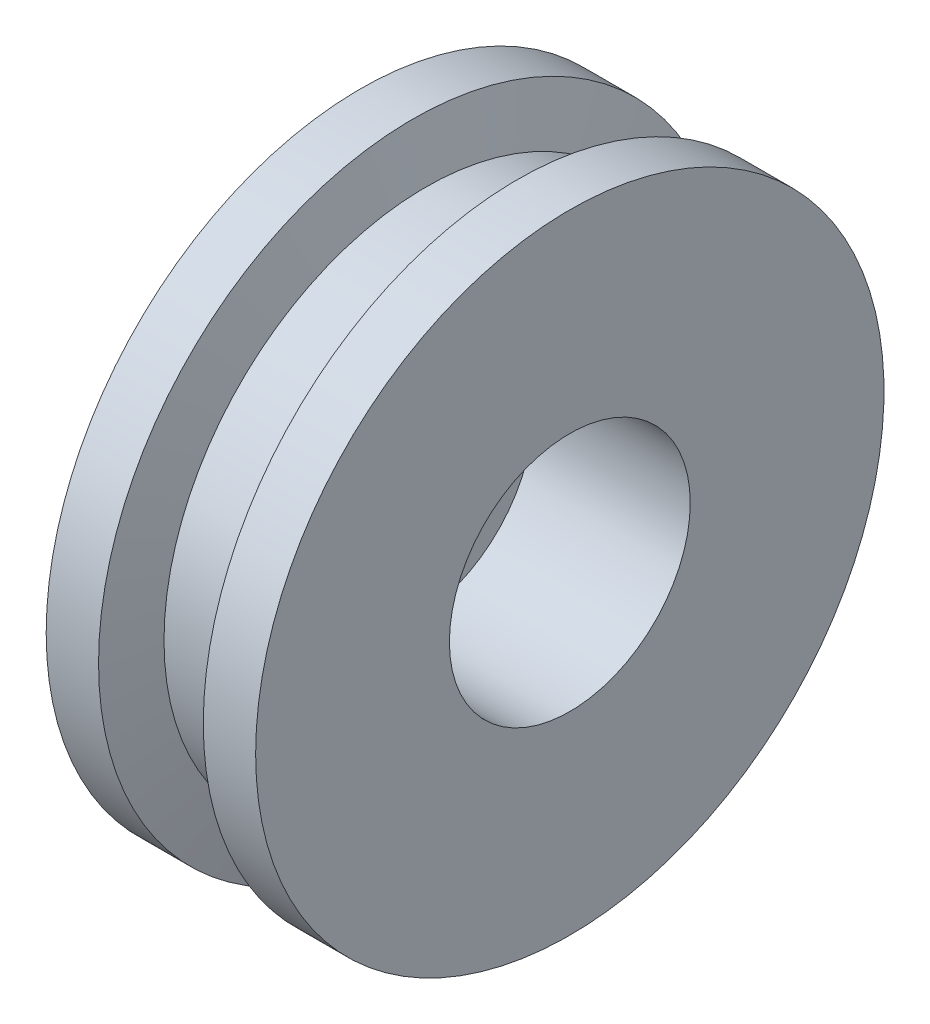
ISO-10303-21;
HEADER;
FILE_DESCRIPTION(('STEP AP214'),'2;1');
FILE_NAME('part.step','',(''),(''),'','','');
FILE_SCHEMA(('AUTOMOTIVE_DESIGN { 1 0 10303 214 1 1 1 1 }'));
ENDSEC;
DATA;
#1=APPLICATION_CONTEXT('core data for automotive mechanical design processes');
#2=APPLICATION_PROTOCOL_DEFINITION('international standard','automotive_design',2000,#1);
#3=PRODUCT_CONTEXT('',#1,'mechanical');
#4=PRODUCT('Part','Part','',(#3));
#5=PRODUCT_RELATED_PRODUCT_CATEGORY('part','',(#4));
#6=PRODUCT_DEFINITION_FORMATION('','',#4);
#7=PRODUCT_DEFINITION_CONTEXT('part definition',#1,'design');
#8=PRODUCT_DEFINITION('design','',#6,#7);
#9=PRODUCT_DEFINITION_SHAPE('','',#8);
#10=(LENGTH_UNIT() NAMED_UNIT(*) SI_UNIT(.MILLI.,.METRE.));
#11=(NAMED_UNIT(*) PLANE_ANGLE_UNIT() SI_UNIT($,.RADIAN.));
#12=(NAMED_UNIT(*) SI_UNIT($,.STERADIAN.) SOLID_ANGLE_UNIT());
#13=UNCERTAINTY_MEASURE_WITH_UNIT(LENGTH_MEASURE(1.E-05),#10,'distance_accuracy_value','');
#14=(GEOMETRIC_REPRESENTATION_CONTEXT(3) GLOBAL_UNCERTAINTY_ASSIGNED_CONTEXT((#13)) GLOBAL_UNIT_ASSIGNED_CONTEXT((#10,
#11,#12)) REPRESENTATION_CONTEXT('',''));
#15=CARTESIAN_POINT('',(0.,0.,0.));
#16=DIRECTION('',(0.,0.,1.));
#17=DIRECTION('',(1.,0.,0.));
#18=AXIS2_PLACEMENT_3D('',#15,#16,#17);
#19=CARTESIAN_POINT('',(-4.,0.,0.));
#20=DIRECTION('',(1.,0.,0.));
#21=DIRECTION('',(0.,0.,-1.));
#22=AXIS2_PLACEMENT_3D('',#19,#20,#21);
#23=PLANE('',#22);
#24=CARTESIAN_POINT('',(-4.,0.,-0.000860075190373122));
#25=DIRECTION('',(-1.,0.,0.));
#26=DIRECTION('',(0.,0.,1.));
#27=AXIS2_PLACEMENT_3D('',#24,#25,#26);
#28=CIRCLE('',#27,3.);
#29=CARTESIAN_POINT('',(-4.,0.,2.99913992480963));
#30=VERTEX_POINT('',#29);
#31=EDGE_CURVE('E76',#30,#30,#28,.T.);
#32=ORIENTED_EDGE('',*,*,#31,.F.);
#33=EDGE_LOOP('',(#32));
#34=FACE_BOUND('',#33,.T.);
#35=CARTESIAN_POINT('',(-4.,0.,0.));
#36=DIRECTION('',(-1.,0.,0.));
#37=DIRECTION('',(0.,0.,1.));
#38=AXIS2_PLACEMENT_3D('',#35,#36,#37);
#39=CIRCLE('',#38,12.);
#40=CARTESIAN_POINT('',(-4.,0.,12.));
#41=VERTEX_POINT('',#40);
#42=EDGE_CURVE('E10',#41,#41,#39,.T.);
#43=ORIENTED_EDGE('',*,*,#42,.T.);
#44=EDGE_LOOP('',(#43));
#45=FACE_BOUND('',#44,.T.);
#46=ADVANCED_FACE('F37',(#34,#45),#23,.F.);
#47=CARTESIAN_POINT('',(-12.9632642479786,0.,0.));
#48=DIRECTION('',(-1.,0.,0.));
#49=DIRECTION('',(0.,0.,1.));
#50=AXIS2_PLACEMENT_3D('',#47,#48,#49);
#51=CYLINDRICAL_SURFACE('',#50,12.);
#52=ORIENTED_EDGE('',*,*,#42,.F.);
#53=EDGE_LOOP('',(#52));
#54=FACE_BOUND('',#53,.T.);
#55=CARTESIAN_POINT('',(-2.,0.,0.));
#56=DIRECTION('',(-1.,0.,0.));
#57=DIRECTION('',(0.,0.,1.));
#58=AXIS2_PLACEMENT_3D('',#55,#56,#57);
#59=CIRCLE('',#58,12.);
#60=CARTESIAN_POINT('',(-2.,0.,12.));
#61=VERTEX_POINT('',#60);
#62=EDGE_CURVE('E45',#61,#61,#59,.T.);
#63=ORIENTED_EDGE('',*,*,#62,.T.);
#64=EDGE_LOOP('',(#63));
#65=FACE_BOUND('',#64,.T.);
#66=ADVANCED_FACE('F118',(#54,#65),#51,.T.);
#67=CARTESIAN_POINT('',(-1.5,0.,0.));
#68=DIRECTION('',(-1.,0.,0.));
#69=DIRECTION('',(0.,0.,1.));
#70=AXIS2_PLACEMENT_3D('',#67,#68,#69);
#71=CONICAL_SURFACE('',#70,10.,1.32581766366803);
#72=ORIENTED_EDGE('',*,*,#62,.F.);
#73=EDGE_LOOP('',(#72));
#74=FACE_BOUND('',#73,.T.);
#75=CARTESIAN_POINT('',(-1.5,0.,0.));
#76=DIRECTION('',(-1.,0.,0.));
#77=DIRECTION('',(0.,0.,1.));
#78=AXIS2_PLACEMENT_3D('',#75,#76,#77);
#79=CIRCLE('',#78,10.);
#80=CARTESIAN_POINT('',(-1.5,0.,10.));
#81=VERTEX_POINT('',#80);
#82=EDGE_CURVE('E50',#81,#81,#79,.T.);
#83=ORIENTED_EDGE('',*,*,#82,.T.);
#84=EDGE_LOOP('',(#83));
#85=FACE_BOUND('',#84,.T.);
#86=ADVANCED_FACE('F123',(#74,#85),#71,.T.);
#87=CARTESIAN_POINT('',(-12.9632642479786,0.,0.));
#88=DIRECTION('',(-1.,0.,0.));
#89=DIRECTION('',(0.,0.,1.));
#90=AXIS2_PLACEMENT_3D('',#87,#88,#89);
#91=CYLINDRICAL_SURFACE('',#90,10.);
#92=ORIENTED_EDGE('',*,*,#82,.F.);
#93=EDGE_LOOP('',(#92));
#94=FACE_BOUND('',#93,.T.);
#95=CARTESIAN_POINT('',(1.5,0.,0.));
#96=DIRECTION('',(-1.,0.,0.));
#97=DIRECTION('',(0.,0.,1.));
#98=AXIS2_PLACEMENT_3D('',#95,#96,#97);
#99=CIRCLE('',#98,10.);
#100=CARTESIAN_POINT('',(1.5,0.,10.));
#101=VERTEX_POINT('',#100);
#102=EDGE_CURVE('E56',#101,#101,#99,.T.);
#103=ORIENTED_EDGE('',*,*,#102,.T.);
#104=EDGE_LOOP('',(#103));
#105=FACE_BOUND('',#104,.T.);
#106=ADVANCED_FACE('F113',(#94,#105),#91,.T.);
#107=CARTESIAN_POINT('',(2.,0.,0.));
#108=DIRECTION('',(1.,0.,0.));
#109=DIRECTION('',(0.,0.,-1.));
#110=AXIS2_PLACEMENT_3D('',#107,#108,#109);
#111=CONICAL_SURFACE('',#110,12.,1.32581766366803);
#112=ORIENTED_EDGE('',*,*,#102,.F.);
#113=EDGE_LOOP('',(#112));
#114=FACE_BOUND('',#113,.T.);
#115=CARTESIAN_POINT('',(2.,0.,0.));
#116=DIRECTION('',(-1.,0.,0.));
#117=DIRECTION('',(0.,0.,1.));
#118=AXIS2_PLACEMENT_3D('',#115,#116,#117);
#119=CIRCLE('',#118,12.);
#120=CARTESIAN_POINT('',(2.,0.,12.));
#121=VERTEX_POINT('',#120);
#122=EDGE_CURVE('E60',#121,#121,#119,.T.);
#123=ORIENTED_EDGE('',*,*,#122,.T.);
#124=EDGE_LOOP('',(#123));
#125=FACE_BOUND('',#124,.T.);
#126=ADVANCED_FACE('F107',(#114,#125),#111,.T.);
#127=CARTESIAN_POINT('',(-12.9632642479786,0.,0.));
#128=DIRECTION('',(-1.,0.,0.));
#129=DIRECTION('',(0.,0.,1.));
#130=AXIS2_PLACEMENT_3D('',#127,#128,#129);
#131=CYLINDRICAL_SURFACE('',#130,12.);
#132=ORIENTED_EDGE('',*,*,#122,.F.);
#133=EDGE_LOOP('',(#132));
#134=FACE_BOUND('',#133,.T.);
#135=CARTESIAN_POINT('',(4.,0.,0.));
#136=DIRECTION('',(-1.,0.,0.));
#137=DIRECTION('',(0.,0.,1.));
#138=AXIS2_PLACEMENT_3D('',#135,#136,#137);
#139=CIRCLE('',#138,12.);
#140=CARTESIAN_POINT('',(4.,0.,12.));
#141=VERTEX_POINT('',#140);
#142=EDGE_CURVE('E64',#141,#141,#139,.T.);
#143=ORIENTED_EDGE('',*,*,#142,.T.);
#144=EDGE_LOOP('',(#143));
#145=FACE_BOUND('',#144,.T.);
#146=ADVANCED_FACE('F102',(#134,#145),#131,.T.);
#147=CARTESIAN_POINT('',(4.,0.,0.));
#148=DIRECTION('',(-1.,0.,0.));
#149=DIRECTION('',(0.,0.,1.));
#150=AXIS2_PLACEMENT_3D('',#147,#148,#149);
#151=PLANE('',#150);
#152=CARTESIAN_POINT('',(4.,0.,0.));
#153=DIRECTION('',(1.,0.,0.));
#154=DIRECTION('',(0.,0.,-1.));
#155=AXIS2_PLACEMENT_3D('',#152,#153,#154);
#156=CIRCLE('',#155,4.6);
#157=CARTESIAN_POINT('',(4.,0.,-4.6));
#158=VERTEX_POINT('',#157);
#159=EDGE_CURVE('E69',#158,#158,#156,.T.);
#160=ORIENTED_EDGE('',*,*,#159,.F.);
#161=EDGE_LOOP('',(#160));
#162=FACE_BOUND('',#161,.T.);
#163=ORIENTED_EDGE('',*,*,#142,.F.);
#164=EDGE_LOOP('',(#163));
#165=FACE_BOUND('',#164,.T.);
#166=ADVANCED_FACE('F96',(#162,#165),#151,.F.);
#167=CARTESIAN_POINT('',(-2.,0.,0.));
#168=DIRECTION('',(1.,0.,0.));
#169=DIRECTION('',(0.,0.,-1.));
#170=AXIS2_PLACEMENT_3D('',#167,#168,#169);
#171=CYLINDRICAL_SURFACE('',#170,4.6);
#172=CARTESIAN_POINT('',(-2.,0.,0.));
#173=DIRECTION('',(1.,0.,0.));
#174=DIRECTION('',(0.,0.,-1.));
#175=AXIS2_PLACEMENT_3D('',#172,#173,#174);
#176=CIRCLE('',#175,4.6);
#177=CARTESIAN_POINT('',(-2.,0.,-4.6));
#178=VERTEX_POINT('',#177);
#179=EDGE_CURVE('E68',#178,#178,#176,.T.);
#180=ORIENTED_EDGE('',*,*,#179,.F.);
#181=EDGE_LOOP('',(#180));
#182=FACE_BOUND('',#181,.T.);
#183=ORIENTED_EDGE('',*,*,#159,.T.);
#184=EDGE_LOOP('',(#183));
#185=FACE_BOUND('',#184,.T.);
#186=ADVANCED_FACE('F90',(#182,#185),#171,.F.);
#187=CARTESIAN_POINT('',(-2.,0.,0.));
#188=DIRECTION('',(1.,0.,0.));
#189=DIRECTION('',(0.,0.,-1.));
#190=AXIS2_PLACEMENT_3D('',#187,#188,#189);
#191=PLANE('',#190);
#192=CARTESIAN_POINT('',(-2.,0.,-0.000860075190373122));
#193=DIRECTION('',(1.,0.,0.));
#194=DIRECTION('',(0.,0.,-1.));
#195=AXIS2_PLACEMENT_3D('',#192,#193,#194);
#196=CIRCLE('',#195,3.);
#197=CARTESIAN_POINT('',(-2.,0.,-3.00086007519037));
#198=VERTEX_POINT('',#197);
#199=EDGE_CURVE('E40',#198,#198,#196,.T.);
#200=ORIENTED_EDGE('',*,*,#199,.F.);
#201=EDGE_LOOP('',(#200));
#202=FACE_BOUND('',#201,.T.);
#203=ORIENTED_EDGE('',*,*,#179,.T.);
#204=EDGE_LOOP('',(#203));
#205=FACE_BOUND('',#204,.T.);
#206=ADVANCED_FACE('F87',(#202,#205),#191,.T.);
#207=CARTESIAN_POINT('',(4.,0.,-0.000860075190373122));
#208=DIRECTION('',(-1.,0.,0.));
#209=DIRECTION('',(0.,0.,1.));
#210=AXIS2_PLACEMENT_3D('',#207,#208,#209);
#211=CYLINDRICAL_SURFACE('',#210,3.);
#212=ORIENTED_EDGE('',*,*,#199,.T.);
#213=EDGE_LOOP('',(#212));
#214=FACE_BOUND('',#213,.T.);
#215=ORIENTED_EDGE('',*,*,#31,.T.);
#216=EDGE_LOOP('',(#215));
#217=FACE_BOUND('',#216,.T.);
#218=ADVANCED_FACE('F85',(#214,#217),#211,.F.);
#219=CLOSED_SHELL('',(#46,#66,#86,#106,#126,#146,#166,#186,#206,#218));
#220=MANIFOLD_SOLID_BREP('B2',#219);
#221=ADVANCED_BREP_SHAPE_REPRESENTATION('',(#18,#220),#14);
#222=SHAPE_DEFINITION_REPRESENTATION(#9,#221);
ENDSEC;
END-ISO-10303-21;
